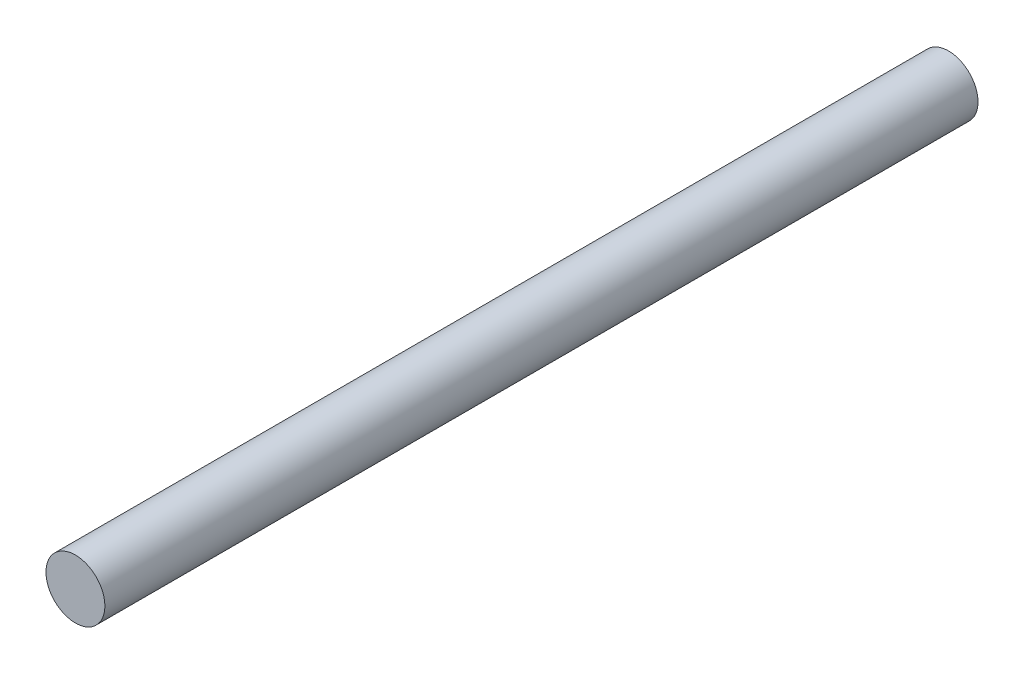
from build123d import *

# Parameters (mm, degrees)
BOSS_EXTRUDE1_DEPTH      = 2.54
BOSS_EXTRUDE1_DEPTH_BACK = 17.78
SKETCH1_R                = 0.6858


with BuildPart() as part:
    # Sketch1 → Boss-Extrude1 (new, two sides: drawn at the far end of the back side and taken through both)
    with BuildSketch(Plane.XY.offset(-BOSS_EXTRUDE1_DEPTH_BACK)):
        with Locations((-2.055903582, -3.8735)):
            Circle(SKETCH1_R)
    extrude(amount=BOSS_EXTRUDE1_DEPTH + BOSS_EXTRUDE1_DEPTH_BACK)


solid = part.part
